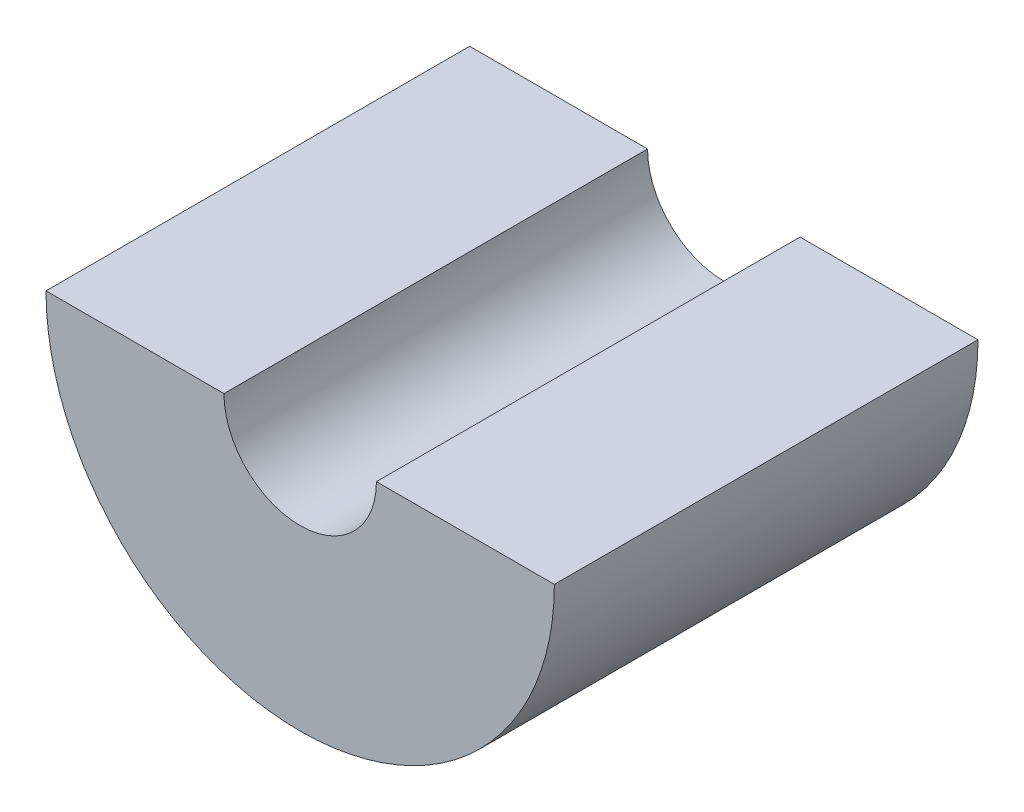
ISO-10303-21;
HEADER;
FILE_DESCRIPTION(('STEP AP214'),'2;1');
FILE_NAME('part.step','',(''),(''),'','','');
FILE_SCHEMA(('AUTOMOTIVE_DESIGN { 1 0 10303 214 1 1 1 1 }'));
ENDSEC;
DATA;
#1=APPLICATION_CONTEXT('core data for automotive mechanical design processes');
#2=APPLICATION_PROTOCOL_DEFINITION('international standard','automotive_design',2000,#1);
#3=PRODUCT_CONTEXT('',#1,'mechanical');
#4=PRODUCT('Part','Part','',(#3));
#5=PRODUCT_RELATED_PRODUCT_CATEGORY('part','',(#4));
#6=PRODUCT_DEFINITION_FORMATION('','',#4);
#7=PRODUCT_DEFINITION_CONTEXT('part definition',#1,'design');
#8=PRODUCT_DEFINITION('design','',#6,#7);
#9=PRODUCT_DEFINITION_SHAPE('','',#8);
#10=(LENGTH_UNIT() NAMED_UNIT(*) SI_UNIT(.MILLI.,.METRE.));
#11=(NAMED_UNIT(*) PLANE_ANGLE_UNIT() SI_UNIT($,.RADIAN.));
#12=(NAMED_UNIT(*) SI_UNIT($,.STERADIAN.) SOLID_ANGLE_UNIT());
#13=UNCERTAINTY_MEASURE_WITH_UNIT(LENGTH_MEASURE(1.E-05),#10,'distance_accuracy_value','');
#14=(GEOMETRIC_REPRESENTATION_CONTEXT(3) GLOBAL_UNCERTAINTY_ASSIGNED_CONTEXT((#13)) GLOBAL_UNIT_ASSIGNED_CONTEXT((#10,
#11,#12)) REPRESENTATION_CONTEXT('',''));
#15=CARTESIAN_POINT('',(0.,0.,0.));
#16=DIRECTION('',(0.,0.,1.));
#17=DIRECTION('',(1.,0.,0.));
#18=AXIS2_PLACEMENT_3D('',#15,#16,#17);
#19=CARTESIAN_POINT('',(0.,0.,50.));
#20=DIRECTION('',(0.,0.,-1.));
#21=DIRECTION('',(-1.,0.,0.));
#22=AXIS2_PLACEMENT_3D('',#19,#20,#21);
#23=CYLINDRICAL_SURFACE('',#22,30.);
#24=CARTESIAN_POINT('',(0.,-30.,21.));
#25=CARTESIAN_POINT('',(-0.223617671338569,-29.9999967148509,21.0000094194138));
#26=CARTESIAN_POINT('',(-0.44737195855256,-29.9974734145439,21.0188150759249));
#27=CARTESIAN_POINT('',(-0.888645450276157,-29.9876502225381,21.0935326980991));
#28=CARTESIAN_POINT('',(-1.10615804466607,-29.9803454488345,21.1494825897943));
#29=CARTESIAN_POINT('',(-1.52849662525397,-29.9617815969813,21.2968034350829));
#30=CARTESIAN_POINT('',(-1.73333136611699,-29.9505252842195,21.3881496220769));
#31=CARTESIAN_POINT('',(-2.1247277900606,-29.9253077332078,21.6036138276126));
#32=CARTESIAN_POINT('',(-2.31129241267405,-29.9113469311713,21.7277265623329));
#33=CARTESIAN_POINT('',(-2.66205164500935,-29.8821798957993,22.0060265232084));
#34=CARTESIAN_POINT('',(-2.82611597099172,-29.8669671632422,22.1603772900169));
#35=CARTESIAN_POINT('',(-3.12609471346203,-29.837062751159,22.4944203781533));
#36=CARTESIAN_POINT('',(-3.26200763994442,-29.8223710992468,22.6741140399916));
#37=CARTESIAN_POINT('',(-3.50231804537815,-29.7951087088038,23.0545982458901));
#38=CARTESIAN_POINT('',(-3.60659214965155,-29.7825463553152,23.2554673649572));
#39=CARTESIAN_POINT('',(-3.7798769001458,-29.7610517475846,23.6720621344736));
#40=CARTESIAN_POINT('',(-3.84888906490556,-29.7521193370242,23.8877871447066));
#41=CARTESIAN_POINT('',(-3.94929213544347,-29.7389587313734,24.3266116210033));
#42=CARTESIAN_POINT('',(-3.98090408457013,-29.7347029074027,24.5496596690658));
#43=CARTESIAN_POINT('',(-4.00629361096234,-29.7312930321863,24.9979323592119));
#44=CARTESIAN_POINT('',(-4.00007291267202,-29.732138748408,25.2231569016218));
#45=CARTESIAN_POINT('',(-3.95015491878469,-29.7388111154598,25.6678422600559));
#46=CARTESIAN_POINT('',(-3.90670195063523,-29.7446052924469,25.8873310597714));
#47=CARTESIAN_POINT('',(-3.78393449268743,-29.7604710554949,26.3158736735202));
#48=CARTESIAN_POINT('',(-3.70461918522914,-29.7705427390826,26.52492724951));
#49=CARTESIAN_POINT('',(-3.51211858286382,-29.7938652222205,26.9274192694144));
#50=CARTESIAN_POINT('',(-3.39882795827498,-29.807125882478,27.1208067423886));
#51=CARTESIAN_POINT('',(-3.14166786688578,-29.8353247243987,27.4859181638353));
#52=CARTESIAN_POINT('',(-2.9977968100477,-29.8502629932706,27.6576409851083));
#53=CARTESIAN_POINT('',(-2.68220980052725,-29.8802779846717,27.9759660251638));
#54=CARTESIAN_POINT('',(-2.51028341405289,-29.8953548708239,28.1223596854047));
#55=CARTESIAN_POINT('',(-2.14418834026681,-29.9238384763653,28.3842440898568));
#56=CARTESIAN_POINT('',(-1.95001958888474,-29.9372451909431,28.499734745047));
#57=CARTESIAN_POINT('',(-1.54478443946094,-29.9608878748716,28.6965382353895));
#58=CARTESIAN_POINT('',(-1.33371115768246,-29.9711225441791,28.7778370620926));
#59=CARTESIAN_POINT('',(-0.900741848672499,-29.9872565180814,28.9037786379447));
#60=CARTESIAN_POINT('',(-0.678846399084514,-29.9931560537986,28.9484233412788));
#61=CARTESIAN_POINT('',(-0.232333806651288,-29.9999248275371,28.9995168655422));
#62=CARTESIAN_POINT('',(-0.00775006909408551,-30.0008318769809,29.006252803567));
#63=CARTESIAN_POINT('',(0.439343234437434,-29.9976158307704,28.9820966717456));
#64=CARTESIAN_POINT('',(0.661852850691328,-29.993492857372,28.9512055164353));
#65=CARTESIAN_POINT('',(1.09762743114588,-29.980703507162,28.852910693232));
#66=CARTESIAN_POINT('',(1.31092403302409,-29.9720542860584,28.7856448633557));
#67=CARTESIAN_POINT('',(1.72321019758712,-29.9511801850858,28.6166540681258));
#68=CARTESIAN_POINT('',(1.92219921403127,-29.9389551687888,28.5149277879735));
#69=CARTESIAN_POINT('',(2.30149775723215,-29.9121967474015,28.2792156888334));
#70=CARTESIAN_POINT('',(2.48169162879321,-29.8976503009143,28.1450452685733));
#71=CARTESIAN_POINT('',(2.81710589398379,-29.8679145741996,27.8485133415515));
#72=CARTESIAN_POINT('',(2.97232515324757,-29.8527252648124,27.6861505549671));
#73=CARTESIAN_POINT('',(3.25441098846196,-29.8232980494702,27.3365737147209));
#74=CARTESIAN_POINT('',(3.38108655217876,-29.809066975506,27.1492048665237));
#75=CARTESIAN_POINT('',(3.60116702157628,-29.7832826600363,26.7556811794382));
#76=CARTESIAN_POINT('',(3.69457267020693,-29.7717293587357,26.5495267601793));
#77=CARTESIAN_POINT('',(3.84515673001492,-29.7526562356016,26.1248855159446));
#78=CARTESIAN_POINT('',(3.90244057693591,-29.745124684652,25.9064366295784));
#79=CARTESIAN_POINT('',(3.97949334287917,-29.7349149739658,25.4629127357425));
#80=CARTESIAN_POINT('',(3.99926426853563,-29.7322365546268,25.2378380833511));
#81=CARTESIAN_POINT('',(4.00068971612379,-29.732044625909,24.789353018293));
#82=CARTESIAN_POINT('',(3.98264438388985,-29.7344904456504,24.5659435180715));
#83=CARTESIAN_POINT('',(3.90958753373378,-29.744183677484,24.1253642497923));
#84=CARTESIAN_POINT('',(3.85457602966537,-29.7514310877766,23.9081944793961));
#85=CARTESIAN_POINT('',(3.70924620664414,-29.7698978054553,23.4863126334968));
#86=CARTESIAN_POINT('',(3.61894441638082,-29.781115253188,23.2815947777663));
#87=CARTESIAN_POINT('',(3.40562685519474,-29.8062609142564,22.8901682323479));
#88=CARTESIAN_POINT('',(3.28261045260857,-29.8201891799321,22.7034598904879));
#89=CARTESIAN_POINT('',(3.00624897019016,-29.8493193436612,22.3518207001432));
#90=CARTESIAN_POINT('',(2.85268054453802,-29.8645301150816,22.1870661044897));
#91=CARTESIAN_POINT('',(2.52004338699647,-29.8944343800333,21.8855535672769));
#92=CARTESIAN_POINT('',(2.34096868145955,-29.9091277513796,21.7488022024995));
#93=CARTESIAN_POINT('',(1.96150597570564,-29.9364127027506,21.506665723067));
#94=CARTESIAN_POINT('',(1.76102924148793,-29.9489949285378,21.4014186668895));
#95=CARTESIAN_POINT('',(1.34518481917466,-29.9705464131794,21.2262388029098));
#96=CARTESIAN_POINT('',(1.12983335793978,-29.9795195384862,21.1562681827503));
#97=CARTESIAN_POINT('',(0.761176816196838,-29.9907144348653,21.0701039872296));
#98=CARTESIAN_POINT('',(0.610182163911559,-29.9941792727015,21.0438535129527));
#99=CARTESIAN_POINT('',(0.306146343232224,-29.9988231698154,21.0087983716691));
#100=CARTESIAN_POINT('',(0.153105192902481,-30.000002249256,20.9999935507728));
#101=CARTESIAN_POINT('',(0.,-30.,21.));
#102=B_SPLINE_CURVE_WITH_KNOTS('',3,(#24,#25,#26,#27,#28,#29,#30,#31,#32,#33,#34,#35,#36,#37,
#38,#39,#40,#41,#42,#43,#44,#45,#46,#47,#48,#49,#50,#51,#52,#53,#54,#55,#56,#57,#58,#59,#60,#61,
#62,#63,#64,#65,#66,#67,#68,#69,#70,#71,#72,#73,#74,#75,#76,#77,#78,#79,#80,#81,#82,#83,#84,#85,
#86,#87,#88,#89,#90,#91,#92,#93,#94,#95,#96,#97,#98,#99,#100,#101),.UNSPECIFIED.,.T.,.F.,(4,2,2,
2,2,2,2,2,2,2,2,2,2,2,2,2,2,2,2,2,2,2,2,2,2,2,2,2,2,2,2,2,2,2,2,2,2,2,4),(0.,0.670293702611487,
1.34127286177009,2.01178338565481,2.68218585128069,3.35631956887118,4.03048895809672,
4.70725443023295,5.38399075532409,6.05670711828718,6.7293928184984,7.39769770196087,
8.06601782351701,8.73643166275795,9.40688036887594,10.082610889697,10.7583433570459,
11.4343524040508,12.1103254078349,12.7811716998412,13.4520016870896,14.1203072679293,
14.7886383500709,15.4608654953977,16.1331231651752,16.809754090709,17.486369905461,
18.1610014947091,18.8355969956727,19.5048585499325,20.1741198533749,20.8430680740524,
21.512029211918,22.1860733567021,22.8602756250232,23.5373905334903,24.2137780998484,
24.6727147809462,25.1316474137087),.UNSPECIFIED.);
#103=CARTESIAN_POINT('',(0.,-30.,21.));
#104=VERTEX_POINT('',#103);
#105=EDGE_CURVE('E12',#104,#104,#102,.T.);
#106=ORIENTED_EDGE('',*,*,#105,.T.);
#107=EDGE_LOOP('',(#106));
#108=FACE_BOUND('',#107,.T.);
#109=CARTESIAN_POINT('',(0.,0.,0.));
#110=DIRECTION('',(0.,0.,1.));
#111=DIRECTION('',(1.,0.,0.));
#112=AXIS2_PLACEMENT_3D('',#109,#110,#111);
#113=CIRCLE('',#112,30.);
#114=CARTESIAN_POINT('',(-30.,0.,0.));
#115=VERTEX_POINT('',#114);
#116=CARTESIAN_POINT('',(30.,0.,0.));
#117=VERTEX_POINT('',#116);
#118=EDGE_CURVE('E99',#115,#117,#113,.T.);
#119=ORIENTED_EDGE('',*,*,#118,.T.);
#120=DIRECTION('',(0.,0.,-1.));
#121=VECTOR('',#120,1.);
#122=CARTESIAN_POINT('',(30.,0.,50.));
#123=LINE('',#122,#121);
#124=CARTESIAN_POINT('',(30.,0.,50.));
#125=VERTEX_POINT('',#124);
#126=EDGE_CURVE('E46',#125,#117,#123,.T.);
#127=ORIENTED_EDGE('',*,*,#126,.F.);
#128=CARTESIAN_POINT('',(0.,0.,50.));
#129=DIRECTION('',(0.,0.,1.));
#130=DIRECTION('',(1.,0.,0.));
#131=AXIS2_PLACEMENT_3D('',#128,#129,#130);
#132=CIRCLE('',#131,30.);
#133=CARTESIAN_POINT('',(-30.,0.,50.));
#134=VERTEX_POINT('',#133);
#135=EDGE_CURVE('E105',#134,#125,#132,.T.);
#136=ORIENTED_EDGE('',*,*,#135,.F.);
#137=DIRECTION('',(0.,0.,-1.));
#138=VECTOR('',#137,1.);
#139=CARTESIAN_POINT('',(-30.,0.,50.));
#140=LINE('',#139,#138);
#141=EDGE_CURVE('E110',#134,#115,#140,.T.);
#142=ORIENTED_EDGE('',*,*,#141,.T.);
#143=EDGE_LOOP('',(#119,#127,#136,#142));
#144=FACE_BOUND('',#143,.T.);
#145=ADVANCED_FACE('F34',(#108,#144),#23,.T.);
#146=CARTESIAN_POINT('',(9.,0.,50.));
#147=DIRECTION('',(0.,-1.,0.));
#148=DIRECTION('',(0.,0.,-1.));
#149=AXIS2_PLACEMENT_3D('',#146,#147,#148);
#150=PLANE('',#149);
#151=DIRECTION('',(-1.,0.,0.));
#152=VECTOR('',#151,1.);
#153=CARTESIAN_POINT('',(9.,0.,0.));
#154=LINE('',#153,#152);
#155=CARTESIAN_POINT('',(9.,0.,0.));
#156=VERTEX_POINT('',#155);
#157=EDGE_CURVE('E102',#117,#156,#154,.T.);
#158=ORIENTED_EDGE('',*,*,#157,.T.);
#159=DIRECTION('',(0.,0.,-1.));
#160=VECTOR('',#159,1.);
#161=CARTESIAN_POINT('',(9.,0.,50.));
#162=LINE('',#161,#160);
#163=CARTESIAN_POINT('',(9.,0.,50.));
#164=VERTEX_POINT('',#163);
#165=EDGE_CURVE('E118',#164,#156,#162,.T.);
#166=ORIENTED_EDGE('',*,*,#165,.F.);
#167=DIRECTION('',(-1.,0.,0.));
#168=VECTOR('',#167,1.);
#169=CARTESIAN_POINT('',(9.,0.,50.));
#170=LINE('',#169,#168);
#171=EDGE_CURVE('E86',#125,#164,#170,.T.);
#172=ORIENTED_EDGE('',*,*,#171,.F.);
#173=ORIENTED_EDGE('',*,*,#126,.T.);
#174=EDGE_LOOP('',(#158,#166,#172,#173));
#175=FACE_BOUND('',#174,.T.);
#176=ADVANCED_FACE('F120',(#175),#150,.F.);
#177=CARTESIAN_POINT('',(0.,0.,50.));
#178=DIRECTION('',(0.,0.,-1.));
#179=DIRECTION('',(-1.,0.,0.));
#180=AXIS2_PLACEMENT_3D('',#177,#178,#179);
#181=CYLINDRICAL_SURFACE('',#180,9.);
#182=CARTESIAN_POINT('',(0.,0.,0.));
#183=DIRECTION('',(0.,0.,-1.));
#184=DIRECTION('',(1.,0.,0.));
#185=AXIS2_PLACEMENT_3D('',#182,#183,#184);
#186=CIRCLE('',#185,9.);
#187=CARTESIAN_POINT('',(-9.,0.,0.));
#188=VERTEX_POINT('',#187);
#189=EDGE_CURVE('E72',#156,#188,#186,.T.);
#190=ORIENTED_EDGE('',*,*,#189,.T.);
#191=DIRECTION('',(0.,0.,-1.));
#192=VECTOR('',#191,1.);
#193=CARTESIAN_POINT('',(-9.,0.,50.));
#194=LINE('',#193,#192);
#195=CARTESIAN_POINT('',(-9.,0.,50.));
#196=VERTEX_POINT('',#195);
#197=EDGE_CURVE('E116',#196,#188,#194,.T.);
#198=ORIENTED_EDGE('',*,*,#197,.F.);
#199=CARTESIAN_POINT('',(0.,0.,50.));
#200=DIRECTION('',(0.,0.,-1.));
#201=DIRECTION('',(1.,0.,0.));
#202=AXIS2_PLACEMENT_3D('',#199,#200,#201);
#203=CIRCLE('',#202,9.);
#204=EDGE_CURVE('E108',#164,#196,#203,.T.);
#205=ORIENTED_EDGE('',*,*,#204,.F.);
#206=ORIENTED_EDGE('',*,*,#165,.T.);
#207=EDGE_LOOP('',(#190,#198,#205,#206));
#208=FACE_BOUND('',#207,.T.);
#209=ADVANCED_FACE('F141',(#208),#181,.F.);
#210=CARTESIAN_POINT('',(-30.,0.,50.));
#211=DIRECTION('',(0.,-1.,0.));
#212=DIRECTION('',(0.,0.,-1.));
#213=AXIS2_PLACEMENT_3D('',#210,#211,#212);
#214=PLANE('',#213);
#215=DIRECTION('',(-1.,0.,0.));
#216=VECTOR('',#215,1.);
#217=CARTESIAN_POINT('',(-30.,0.,0.));
#218=LINE('',#217,#216);
#219=EDGE_CURVE('E78',#188,#115,#218,.T.);
#220=ORIENTED_EDGE('',*,*,#219,.T.);
#221=ORIENTED_EDGE('',*,*,#141,.F.);
#222=DIRECTION('',(-1.,0.,0.));
#223=VECTOR('',#222,1.);
#224=CARTESIAN_POINT('',(-30.,0.,50.));
#225=LINE('',#224,#223);
#226=EDGE_CURVE('E54',#196,#134,#225,.T.);
#227=ORIENTED_EDGE('',*,*,#226,.F.);
#228=ORIENTED_EDGE('',*,*,#197,.T.);
#229=EDGE_LOOP('',(#220,#221,#227,#228));
#230=FACE_BOUND('',#229,.T.);
#231=ADVANCED_FACE('F133',(#230),#214,.F.);
#232=CARTESIAN_POINT('',(0.,0.,50.));
#233=DIRECTION('',(0.,0.,1.));
#234=DIRECTION('',(1.,0.,0.));
#235=AXIS2_PLACEMENT_3D('',#232,#233,#234);
#236=PLANE('',#235);
#237=ORIENTED_EDGE('',*,*,#135,.T.);
#238=ORIENTED_EDGE('',*,*,#171,.T.);
#239=ORIENTED_EDGE('',*,*,#204,.T.);
#240=ORIENTED_EDGE('',*,*,#226,.T.);
#241=EDGE_LOOP('',(#237,#238,#239,#240));
#242=FACE_BOUND('',#241,.T.);
#243=ADVANCED_FACE('F127',(#242),#236,.T.);
#244=CARTESIAN_POINT('',(0.,0.,0.));
#245=DIRECTION('',(0.,0.,1.));
#246=DIRECTION('',(1.,0.,0.));
#247=AXIS2_PLACEMENT_3D('',#244,#245,#246);
#248=PLANE('',#247);
#249=ORIENTED_EDGE('',*,*,#118,.F.);
#250=ORIENTED_EDGE('',*,*,#219,.F.);
#251=ORIENTED_EDGE('',*,*,#189,.F.);
#252=ORIENTED_EDGE('',*,*,#157,.F.);
#253=EDGE_LOOP('',(#249,#250,#251,#252));
#254=FACE_BOUND('',#253,.T.);
#255=ADVANCED_FACE('F125',(#254),#248,.F.);
#256=CARTESIAN_POINT('',(0.,-30.,25.));
#257=DIRECTION('',(0.,-1.,0.));
#258=DIRECTION('',(0.,0.,-1.));
#259=AXIS2_PLACEMENT_3D('',#256,#257,#258);
#260=CYLINDRICAL_SURFACE('',#259,4.);
#261=CARTESIAN_POINT('',(0.,-19.,25.));
#262=DIRECTION('',(0.,-1.,0.));
#263=DIRECTION('',(0.,0.,-1.));
#264=AXIS2_PLACEMENT_3D('',#261,#262,#263);
#265=CIRCLE('',#264,4.);
#266=CARTESIAN_POINT('',(0.,-19.,21.));
#267=VERTEX_POINT('',#266);
#268=EDGE_CURVE('E97',#267,#267,#265,.T.);
#269=ORIENTED_EDGE('',*,*,#268,.F.);
#270=EDGE_LOOP('',(#269));
#271=FACE_BOUND('',#270,.T.);
#272=ORIENTED_EDGE('',*,*,#105,.F.);
#273=EDGE_LOOP('',(#272));
#274=FACE_BOUND('',#273,.T.);
#275=ADVANCED_FACE('F93',(#271,#274),#260,.F.);
#276=CARTESIAN_POINT('',(0.,-19.,25.));
#277=DIRECTION('',(0.,-1.,0.));
#278=DIRECTION('',(0.,0.,-1.));
#279=AXIS2_PLACEMENT_3D('',#276,#277,#278);
#280=CONICAL_SURFACE('',#279,4.,1.02974425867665);
#281=CARTESIAN_POINT('',(0.,-16.5965575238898,25.));
#282=VERTEX_POINT('',#281);
#283=VERTEX_LOOP('',#282);
#284=FACE_BOUND('',#283,.T.);
#285=ORIENTED_EDGE('',*,*,#268,.T.);
#286=EDGE_LOOP('',(#285));
#287=FACE_BOUND('',#286,.T.);
#288=ADVANCED_FACE('F90',(#284,#287),#280,.F.);
#289=CLOSED_SHELL('',(#145,#176,#209,#231,#243,#255,#275,#288));
#290=MANIFOLD_SOLID_BREP('B2',#289);
#291=ADVANCED_BREP_SHAPE_REPRESENTATION('',(#18,#290),#14);
#292=SHAPE_DEFINITION_REPRESENTATION(#9,#291);
ENDSEC;
END-ISO-10303-21;
